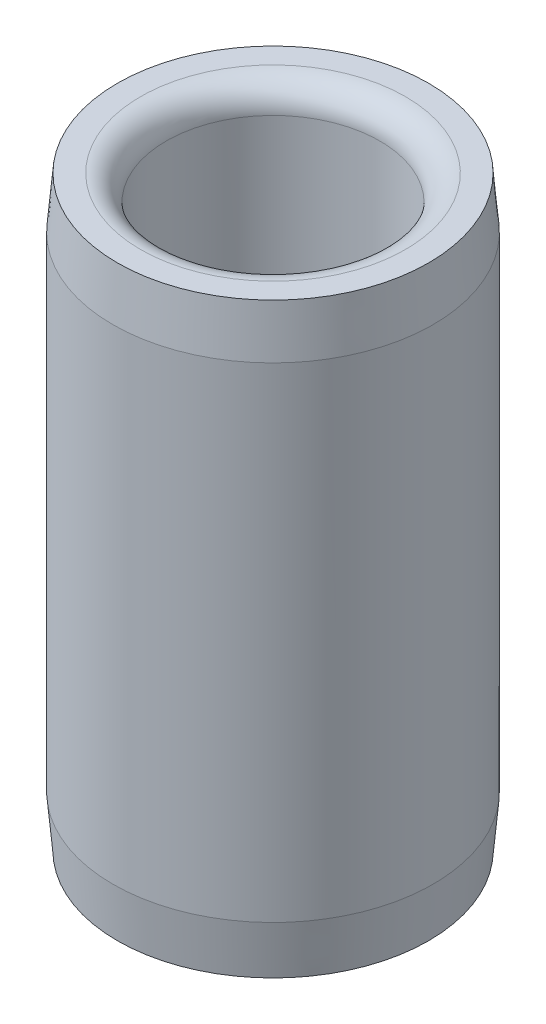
ISO-10303-21;
HEADER;
FILE_DESCRIPTION(('STEP AP214'),'2;1');
FILE_NAME('part.step','',(''),(''),'','','');
FILE_SCHEMA(('AUTOMOTIVE_DESIGN { 1 0 10303 214 1 1 1 1 }'));
ENDSEC;
DATA;
#1=APPLICATION_CONTEXT('core data for automotive mechanical design processes');
#2=APPLICATION_PROTOCOL_DEFINITION('international standard','automotive_design',2000,#1);
#3=PRODUCT_CONTEXT('',#1,'mechanical');
#4=PRODUCT('Part','Part','',(#3));
#5=PRODUCT_RELATED_PRODUCT_CATEGORY('part','',(#4));
#6=PRODUCT_DEFINITION_FORMATION('','',#4);
#7=PRODUCT_DEFINITION_CONTEXT('part definition',#1,'design');
#8=PRODUCT_DEFINITION('design','',#6,#7);
#9=PRODUCT_DEFINITION_SHAPE('','',#8);
#10=(LENGTH_UNIT() NAMED_UNIT(*) SI_UNIT(.MILLI.,.METRE.));
#11=(NAMED_UNIT(*) PLANE_ANGLE_UNIT() SI_UNIT($,.RADIAN.));
#12=(NAMED_UNIT(*) SI_UNIT($,.STERADIAN.) SOLID_ANGLE_UNIT());
#13=UNCERTAINTY_MEASURE_WITH_UNIT(LENGTH_MEASURE(1.E-05),#10,'distance_accuracy_value','');
#14=(GEOMETRIC_REPRESENTATION_CONTEXT(3) GLOBAL_UNCERTAINTY_ASSIGNED_CONTEXT((#13)) GLOBAL_UNIT_ASSIGNED_CONTEXT((#10,
#11,#12)) REPRESENTATION_CONTEXT('',''));
#15=CARTESIAN_POINT('',(0.,0.,0.));
#16=DIRECTION('',(0.,0.,1.));
#17=DIRECTION('',(1.,0.,0.));
#18=AXIS2_PLACEMENT_3D('',#15,#16,#17);
#19=CARTESIAN_POINT('',(0.,20.0804824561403,0.));
#20=DIRECTION('',(0.,1.,0.));
#21=DIRECTION('',(0.,0.,1.));
#22=AXIS2_PLACEMENT_3D('',#19,#20,#21);
#23=CYLINDRICAL_SURFACE('',#22,6.35635);
#24=CARTESIAN_POINT('',(0.,1.524,0.));
#25=DIRECTION('',(0.,-1.,0.));
#26=DIRECTION('',(0.,0.,-1.));
#27=AXIS2_PLACEMENT_3D('',#24,#25,#26);
#28=CIRCLE('',#27,6.35635);
#29=CARTESIAN_POINT('',(0.,1.524,-6.35635));
#30=VERTEX_POINT('',#29);
#31=EDGE_CURVE('E37',#30,#30,#28,.T.);
#32=ORIENTED_EDGE('',*,*,#31,.T.);
#33=EDGE_LOOP('',(#32));
#34=FACE_BOUND('',#33,.T.);
#35=CARTESIAN_POINT('',(0.,33.401,0.));
#36=DIRECTION('',(0.,1.,0.));
#37=DIRECTION('',(0.,0.,1.));
#38=AXIS2_PLACEMENT_3D('',#35,#36,#37);
#39=CIRCLE('',#38,6.35635);
#40=CARTESIAN_POINT('',(0.,33.401,6.35635));
#41=VERTEX_POINT('',#40);
#42=EDGE_CURVE('E41',#41,#41,#39,.T.);
#43=ORIENTED_EDGE('',*,*,#42,.T.);
#44=EDGE_LOOP('',(#43));
#45=FACE_BOUND('',#44,.T.);
#46=ADVANCED_FACE('F30',(#34,#45),#23,.F.);
#47=CARTESIAN_POINT('',(-6.35635,0.,0.));
#48=DIRECTION('',(0.,-1.,0.));
#49=DIRECTION('',(0.,0.,-1.));
#50=AXIS2_PLACEMENT_3D('',#47,#48,#49);
#51=PLANE('',#50);
#52=CARTESIAN_POINT('',(0.,0.,0.));
#53=DIRECTION('',(0.,-1.,0.));
#54=DIRECTION('',(0.,0.,-1.));
#55=AXIS2_PLACEMENT_3D('',#52,#53,#54);
#56=CIRCLE('',#55,7.88035);
#57=CARTESIAN_POINT('',(0.,0.,-7.88035));
#58=VERTEX_POINT('',#57);
#59=EDGE_CURVE('E45',#58,#58,#56,.F.);
#60=ORIENTED_EDGE('',*,*,#59,.T.);
#61=EDGE_LOOP('',(#60));
#62=FACE_BOUND('',#61,.T.);
#63=CARTESIAN_POINT('',(0.,0.,0.));
#64=DIRECTION('',(0.,-1.,0.));
#65=DIRECTION('',(0.,0.,-1.));
#66=AXIS2_PLACEMENT_3D('',#63,#64,#65);
#67=CIRCLE('',#66,9.25833455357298);
#68=CARTESIAN_POINT('',(0.,0.,-9.25833455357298));
#69=VERTEX_POINT('',#68);
#70=EDGE_CURVE('E53',#69,#69,#67,.T.);
#71=ORIENTED_EDGE('',*,*,#70,.T.);
#72=EDGE_LOOP('',(#71));
#73=FACE_BOUND('',#72,.T.);
#74=ADVANCED_FACE('F82',(#62,#73),#51,.T.);
#75=CARTESIAN_POINT('',(0.,20.0804824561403,0.));
#76=DIRECTION('',(0.,1.,0.));
#77=DIRECTION('',(0.,0.,1.));
#78=AXIS2_PLACEMENT_3D('',#75,#76,#77);
#79=CYLINDRICAL_SURFACE('',#78,9.525);
#80=CARTESIAN_POINT('',(0.,3.04800000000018,0.));
#81=DIRECTION('',(0.,-1.,0.));
#82=DIRECTION('',(0.,0.,-1.));
#83=AXIS2_PLACEMENT_3D('',#80,#81,#82);
#84=CIRCLE('',#83,9.525);
#85=CARTESIAN_POINT('',(0.,3.04800000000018,-9.525));
#86=VERTEX_POINT('',#85);
#87=EDGE_CURVE('E56',#86,#86,#84,.F.);
#88=ORIENTED_EDGE('',*,*,#87,.T.);
#89=EDGE_LOOP('',(#88));
#90=FACE_BOUND('',#89,.T.);
#91=CARTESIAN_POINT('',(0.,31.8770000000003,0.));
#92=DIRECTION('',(0.,1.,0.));
#93=DIRECTION('',(0.,0.,1.));
#94=AXIS2_PLACEMENT_3D('',#91,#92,#93);
#95=CIRCLE('',#94,9.525);
#96=CARTESIAN_POINT('',(0.,31.8770000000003,9.525));
#97=VERTEX_POINT('',#96);
#98=EDGE_CURVE('E59',#97,#97,#95,.F.);
#99=ORIENTED_EDGE('',*,*,#98,.T.);
#100=EDGE_LOOP('',(#99));
#101=FACE_BOUND('',#100,.T.);
#102=ADVANCED_FACE('F63',(#90,#101),#79,.T.);
#103=CARTESIAN_POINT('',(-9.525,34.925,0.));
#104=DIRECTION('',(0.,1.,0.));
#105=DIRECTION('',(0.,0.,1.));
#106=AXIS2_PLACEMENT_3D('',#103,#104,#105);
#107=PLANE('',#106);
#108=CARTESIAN_POINT('',(0.,34.925,0.));
#109=DIRECTION('',(0.,1.,0.));
#110=DIRECTION('',(0.,0.,1.));
#111=AXIS2_PLACEMENT_3D('',#108,#109,#110);
#112=CIRCLE('',#111,7.88035);
#113=CARTESIAN_POINT('',(0.,34.925,7.88035));
#114=VERTEX_POINT('',#113);
#115=EDGE_CURVE('E10',#114,#114,#112,.F.);
#116=ORIENTED_EDGE('',*,*,#115,.T.);
#117=EDGE_LOOP('',(#116));
#118=FACE_BOUND('',#117,.T.);
#119=CARTESIAN_POINT('',(0.,34.925,0.));
#120=DIRECTION('',(0.,1.,0.));
#121=DIRECTION('',(0.,0.,1.));
#122=AXIS2_PLACEMENT_3D('',#119,#120,#121);
#123=CIRCLE('',#122,9.25833455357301);
#124=CARTESIAN_POINT('',(0.,34.925,9.25833455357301));
#125=VERTEX_POINT('',#124);
#126=EDGE_CURVE('E50',#125,#125,#123,.T.);
#127=ORIENTED_EDGE('',*,*,#126,.T.);
#128=EDGE_LOOP('',(#127));
#129=FACE_BOUND('',#128,.T.);
#130=ADVANCED_FACE('F73',(#118,#129),#107,.T.);
#131=CARTESIAN_POINT('',(0.,3.04800000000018,0.));
#132=DIRECTION('',(0.,1.,0.));
#133=DIRECTION('',(0.,0.,1.));
#134=AXIS2_PLACEMENT_3D('',#131,#132,#133);
#135=CONICAL_SURFACE('',#134,9.525,0.0872664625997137);
#136=ORIENTED_EDGE('',*,*,#70,.F.);
#137=EDGE_LOOP('',(#136));
#138=FACE_BOUND('',#137,.T.);
#139=ORIENTED_EDGE('',*,*,#87,.F.);
#140=EDGE_LOOP('',(#139));
#141=FACE_BOUND('',#140,.T.);
#142=ADVANCED_FACE('F69',(#138,#141),#135,.T.);
#143=CARTESIAN_POINT('',(0.,34.925,0.));
#144=DIRECTION('',(0.,-1.,0.));
#145=DIRECTION('',(0.,0.,-1.));
#146=AXIS2_PLACEMENT_3D('',#143,#144,#145);
#147=CONICAL_SURFACE('',#146,9.25833455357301,0.0872664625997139);
#148=ORIENTED_EDGE('',*,*,#98,.F.);
#149=EDGE_LOOP('',(#148));
#150=FACE_BOUND('',#149,.T.);
#151=ORIENTED_EDGE('',*,*,#126,.F.);
#152=EDGE_LOOP('',(#151));
#153=FACE_BOUND('',#152,.T.);
#154=ADVANCED_FACE('F65',(#150,#153),#147,.T.);
#155=CARTESIAN_POINT('',(0.,1.524,0.));
#156=DIRECTION('',(0.,-1.,0.));
#157=DIRECTION('',(0.,0.,-1.));
#158=AXIS2_PLACEMENT_3D('',#155,#156,#157);
#159=TOROIDAL_SURFACE('',#158,7.88035,1.524);
#160=ORIENTED_EDGE('',*,*,#31,.F.);
#161=EDGE_LOOP('',(#160));
#162=FACE_BOUND('',#161,.T.);
#163=ORIENTED_EDGE('',*,*,#59,.F.);
#164=EDGE_LOOP('',(#163));
#165=FACE_BOUND('',#164,.T.);
#166=ADVANCED_FACE('F68',(#162,#165),#159,.T.);
#167=CARTESIAN_POINT('',(0.,33.401,0.));
#168=DIRECTION('',(0.,1.,0.));
#169=DIRECTION('',(0.,0.,1.));
#170=AXIS2_PLACEMENT_3D('',#167,#168,#169);
#171=TOROIDAL_SURFACE('',#170,7.88035,1.524);
#172=ORIENTED_EDGE('',*,*,#115,.F.);
#173=EDGE_LOOP('',(#172));
#174=FACE_BOUND('',#173,.T.);
#175=ORIENTED_EDGE('',*,*,#42,.F.);
#176=EDGE_LOOP('',(#175));
#177=FACE_BOUND('',#176,.T.);
#178=ADVANCED_FACE('F32',(#174,#177),#171,.T.);
#179=CLOSED_SHELL('',(#46,#74,#102,#130,#142,#154,#166,#178));
#180=MANIFOLD_SOLID_BREP('B2',#179);
#181=ADVANCED_BREP_SHAPE_REPRESENTATION('',(#18,#180),#14);
#182=SHAPE_DEFINITION_REPRESENTATION(#9,#181);
ENDSEC;
END-ISO-10303-21;
